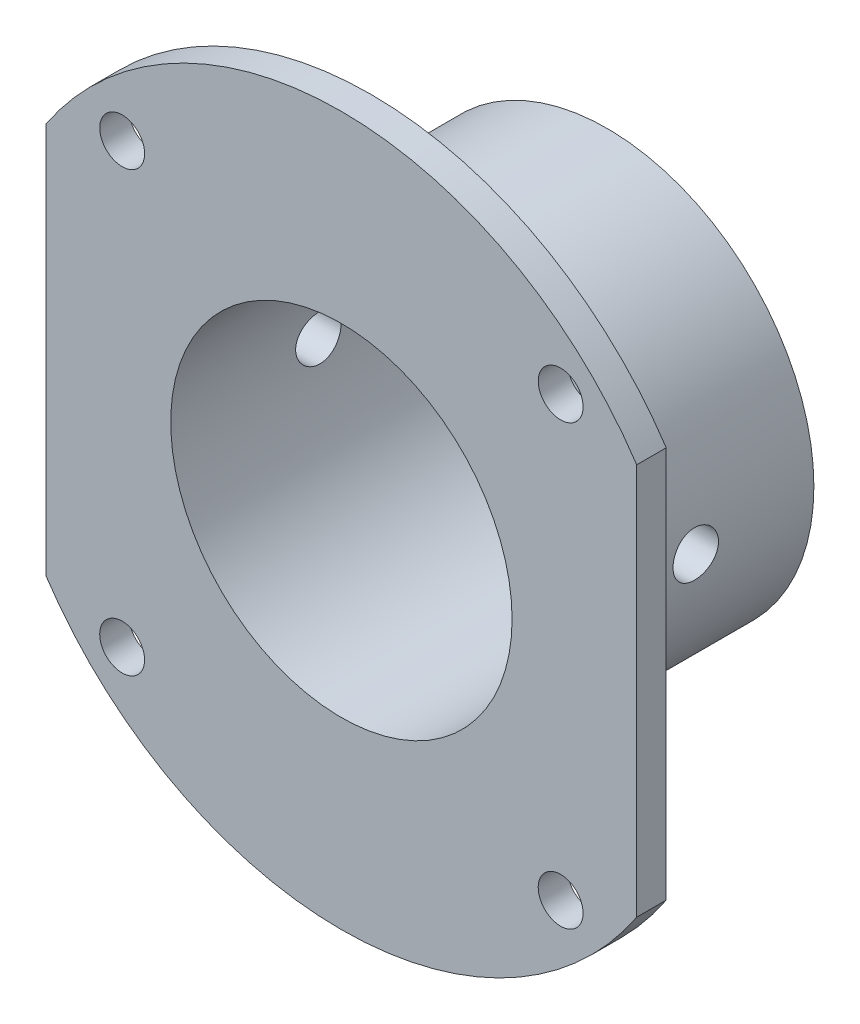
ISO-10303-21;
HEADER;
FILE_DESCRIPTION(('STEP AP214'),'2;1');
FILE_NAME('part.step','',(''),(''),'','','');
FILE_SCHEMA(('AUTOMOTIVE_DESIGN { 1 0 10303 214 1 1 1 1 }'));
ENDSEC;
DATA;
#1=APPLICATION_CONTEXT('core data for automotive mechanical design processes');
#2=APPLICATION_PROTOCOL_DEFINITION('international standard','automotive_design',2000,#1);
#3=PRODUCT_CONTEXT('',#1,'mechanical');
#4=PRODUCT('Part','Part','',(#3));
#5=PRODUCT_RELATED_PRODUCT_CATEGORY('part','',(#4));
#6=PRODUCT_DEFINITION_FORMATION('','',#4);
#7=PRODUCT_DEFINITION_CONTEXT('part definition',#1,'design');
#8=PRODUCT_DEFINITION('design','',#6,#7);
#9=PRODUCT_DEFINITION_SHAPE('','',#8);
#10=(LENGTH_UNIT() NAMED_UNIT(*) SI_UNIT(.MILLI.,.METRE.));
#11=(NAMED_UNIT(*) PLANE_ANGLE_UNIT() SI_UNIT($,.RADIAN.));
#12=(NAMED_UNIT(*) SI_UNIT($,.STERADIAN.) SOLID_ANGLE_UNIT());
#13=UNCERTAINTY_MEASURE_WITH_UNIT(LENGTH_MEASURE(1.E-05),#10,'distance_accuracy_value','');
#14=(GEOMETRIC_REPRESENTATION_CONTEXT(3) GLOBAL_UNCERTAINTY_ASSIGNED_CONTEXT((#13)) GLOBAL_UNIT_ASSIGNED_CONTEXT((#10,
#11,#12)) REPRESENTATION_CONTEXT('',''));
#15=CARTESIAN_POINT('',(0.,0.,0.));
#16=DIRECTION('',(0.,0.,1.));
#17=DIRECTION('',(1.,0.,0.));
#18=AXIS2_PLACEMENT_3D('',#15,#16,#17);
#19=CARTESIAN_POINT('',(0.,0.,50.8));
#20=DIRECTION('',(0.,0.,1.));
#21=DIRECTION('',(1.,0.,0.));
#22=AXIS2_PLACEMENT_3D('',#19,#20,#21);
#23=PLANE('',#22);
#24=CARTESIAN_POINT('',(0.,0.,50.8));
#25=DIRECTION('',(0.,0.,1.));
#26=DIRECTION('',(1.,0.,0.));
#27=AXIS2_PLACEMENT_3D('',#24,#25,#26);
#28=CIRCLE('',#27,44.45);
#29=CARTESIAN_POINT('',(44.45,0.,50.8));
#30=VERTEX_POINT('',#29);
#31=EDGE_CURVE('E104',#30,#30,#28,.T.);
#32=ORIENTED_EDGE('',*,*,#31,.T.);
#33=EDGE_LOOP('',(#32));
#34=FACE_BOUND('',#33,.T.);
#35=CARTESIAN_POINT('',(47.1502889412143,47.1424,50.8));
#36=DIRECTION('',(0.,0.,1.));
#37=DIRECTION('',(1.,0.,0.));
#38=AXIS2_PLACEMENT_3D('',#35,#36,#37);
#39=CIRCLE('',#38,4.826);
#40=CARTESIAN_POINT('',(51.9762889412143,47.1424,50.8));
#41=VERTEX_POINT('',#40);
#42=EDGE_CURVE('E168',#41,#41,#39,.T.);
#43=ORIENTED_EDGE('',*,*,#42,.T.);
#44=EDGE_LOOP('',(#43));
#45=FACE_BOUND('',#44,.T.);
#46=CARTESIAN_POINT('',(47.1423999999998,-47.1502889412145,50.8));
#47=DIRECTION('',(0.,0.,1.));
#48=DIRECTION('',(1.,0.,0.));
#49=AXIS2_PLACEMENT_3D('',#46,#47,#48);
#50=CIRCLE('',#49,4.826);
#51=CARTESIAN_POINT('',(51.9683999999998,-47.1502889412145,50.8));
#52=VERTEX_POINT('',#51);
#53=EDGE_CURVE('E162',#52,#52,#50,.T.);
#54=ORIENTED_EDGE('',*,*,#53,.T.);
#55=EDGE_LOOP('',(#54));
#56=FACE_BOUND('',#55,.T.);
#57=CARTESIAN_POINT('',(-47.1502889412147,-47.1423999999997,50.8));
#58=DIRECTION('',(0.,0.,1.));
#59=DIRECTION('',(1.,0.,0.));
#60=AXIS2_PLACEMENT_3D('',#57,#58,#59);
#61=CIRCLE('',#60,4.826);
#62=CARTESIAN_POINT('',(-42.3242889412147,-47.1423999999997,50.8));
#63=VERTEX_POINT('',#62);
#64=EDGE_CURVE('E156',#63,#63,#61,.T.);
#65=ORIENTED_EDGE('',*,*,#64,.T.);
#66=EDGE_LOOP('',(#65));
#67=FACE_BOUND('',#66,.T.);
#68=CARTESIAN_POINT('',(-47.1423999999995,47.1502889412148,50.8));
#69=DIRECTION('',(0.,0.,1.));
#70=DIRECTION('',(1.,0.,0.));
#71=AXIS2_PLACEMENT_3D('',#68,#69,#70);
#72=CIRCLE('',#71,4.826);
#73=CARTESIAN_POINT('',(-42.3163999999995,47.1502889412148,50.8));
#74=VERTEX_POINT('',#73);
#75=EDGE_CURVE('E150',#74,#74,#72,.T.);
#76=ORIENTED_EDGE('',*,*,#75,.T.);
#77=EDGE_LOOP('',(#76));
#78=FACE_BOUND('',#77,.T.);
#79=DIRECTION('',(0.,-1.,0.));
#80=VECTOR('',#79,1.);
#81=CARTESIAN_POINT('',(-63.5,0.,50.8));
#82=LINE('',#81,#80);
#83=CARTESIAN_POINT('',(-63.5,42.1211348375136,50.8));
#84=VERTEX_POINT('',#83);
#85=CARTESIAN_POINT('',(-63.5,-42.1211348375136,50.8));
#86=VERTEX_POINT('',#85);
#87=EDGE_CURVE('E90',#84,#86,#82,.T.);
#88=ORIENTED_EDGE('',*,*,#87,.F.);
#89=CARTESIAN_POINT('',(0.,0.,50.8));
#90=DIRECTION('',(0.,0.,1.));
#91=DIRECTION('',(1.,0.,0.));
#92=AXIS2_PLACEMENT_3D('',#89,#90,#91);
#93=CIRCLE('',#92,76.2);
#94=CARTESIAN_POINT('',(63.5,42.1211348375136,50.8));
#95=VERTEX_POINT('',#94);
#96=EDGE_CURVE('E88',#95,#84,#93,.T.);
#97=ORIENTED_EDGE('',*,*,#96,.F.);
#98=DIRECTION('',(0.,-1.,0.));
#99=VECTOR('',#98,1.);
#100=CARTESIAN_POINT('',(63.5,0.,50.8));
#101=LINE('',#100,#99);
#102=CARTESIAN_POINT('',(63.5,-42.1211348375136,50.8));
#103=VERTEX_POINT('',#102);
#104=EDGE_CURVE('E182',#95,#103,#101,.T.);
#105=ORIENTED_EDGE('',*,*,#104,.T.);
#106=EDGE_CURVE('E172',#86,#103,#93,.T.);
#107=ORIENTED_EDGE('',*,*,#106,.F.);
#108=EDGE_LOOP('',(#88,#97,#105,#107));
#109=FACE_BOUND('',#108,.T.);
#110=ADVANCED_FACE('F36',(#34,#45,#56,#67,#78,#109),#23,.F.);
#111=CARTESIAN_POINT('',(0.,0.,57.15));
#112=DIRECTION('',(0.,0.,-1.));
#113=DIRECTION('',(-1.,0.,0.));
#114=AXIS2_PLACEMENT_3D('',#111,#112,#113);
#115=CYLINDRICAL_SURFACE('',#114,76.2);
#116=DIRECTION('',(0.,0.,-1.));
#117=VECTOR('',#116,1.);
#118=CARTESIAN_POINT('',(-63.5,42.1211348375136,57.15));
#119=LINE('',#118,#117);
#120=CARTESIAN_POINT('',(-63.5,42.1211348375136,57.15));
#121=VERTEX_POINT('',#120);
#122=EDGE_CURVE('E77',#121,#84,#119,.T.);
#123=ORIENTED_EDGE('',*,*,#122,.F.);
#124=CARTESIAN_POINT('',(0.,0.,57.15));
#125=DIRECTION('',(0.,0.,1.));
#126=DIRECTION('',(1.,0.,0.));
#127=AXIS2_PLACEMENT_3D('',#124,#125,#126);
#128=CIRCLE('',#127,76.2);
#129=CARTESIAN_POINT('',(63.5,42.1211348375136,57.15));
#130=VERTEX_POINT('',#129);
#131=EDGE_CURVE('E86',#130,#121,#128,.T.);
#132=ORIENTED_EDGE('',*,*,#131,.F.);
#133=DIRECTION('',(0.,0.,-1.));
#134=VECTOR('',#133,1.);
#135=CARTESIAN_POINT('',(63.5,42.1211348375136,57.15));
#136=LINE('',#135,#134);
#137=EDGE_CURVE('E59',#130,#95,#136,.T.);
#138=ORIENTED_EDGE('',*,*,#137,.T.);
#139=ORIENTED_EDGE('',*,*,#96,.T.);
#140=EDGE_LOOP('',(#123,#132,#138,#139));
#141=FACE_BOUND('',#140,.T.);
#142=ADVANCED_FACE('F85',(#141),#115,.T.);
#143=DIRECTION('',(0.,0.,-1.));
#144=VECTOR('',#143,1.);
#145=CARTESIAN_POINT('',(-63.5,-42.1211348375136,57.15));
#146=LINE('',#145,#144);
#147=CARTESIAN_POINT('',(-63.5,-42.1211348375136,57.15));
#148=VERTEX_POINT('',#147);
#149=EDGE_CURVE('E52',#86,#148,#146,.F.);
#150=ORIENTED_EDGE('',*,*,#149,.F.);
#151=ORIENTED_EDGE('',*,*,#106,.T.);
#152=DIRECTION('',(0.,0.,-1.));
#153=VECTOR('',#152,1.);
#154=CARTESIAN_POINT('',(63.5,-42.1211348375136,57.15));
#155=LINE('',#154,#153);
#156=CARTESIAN_POINT('',(63.5,-42.1211348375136,57.15));
#157=VERTEX_POINT('',#156);
#158=EDGE_CURVE('E89',#103,#157,#155,.F.);
#159=ORIENTED_EDGE('',*,*,#158,.T.);
#160=EDGE_CURVE('E94',#148,#157,#128,.T.);
#161=ORIENTED_EDGE('',*,*,#160,.F.);
#162=EDGE_LOOP('',(#150,#151,#159,#161));
#163=FACE_BOUND('',#162,.T.);
#164=ADVANCED_FACE('F179',(#163),#115,.T.);
#165=CARTESIAN_POINT('',(0.,0.,57.15));
#166=DIRECTION('',(0.,0.,1.));
#167=DIRECTION('',(1.,0.,0.));
#168=AXIS2_PLACEMENT_3D('',#165,#166,#167);
#169=PLANE('',#168);
#170=CARTESIAN_POINT('',(0.,0.,57.15));
#171=DIRECTION('',(0.,0.,1.));
#172=DIRECTION('',(1.,0.,0.));
#173=AXIS2_PLACEMENT_3D('',#170,#171,#172);
#174=CIRCLE('',#173,36.703);
#175=CARTESIAN_POINT('',(36.703,0.,57.15));
#176=VERTEX_POINT('',#175);
#177=EDGE_CURVE('E170',#176,#176,#174,.T.);
#178=ORIENTED_EDGE('',*,*,#177,.F.);
#179=EDGE_LOOP('',(#178));
#180=FACE_BOUND('',#179,.T.);
#181=CARTESIAN_POINT('',(47.1502889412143,47.1424,57.15));
#182=DIRECTION('',(0.,0.,1.));
#183=DIRECTION('',(1.,0.,0.));
#184=AXIS2_PLACEMENT_3D('',#181,#182,#183);
#185=CIRCLE('',#184,4.826);
#186=CARTESIAN_POINT('',(51.9762889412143,47.1424,57.15));
#187=VERTEX_POINT('',#186);
#188=EDGE_CURVE('E165',#187,#187,#185,.T.);
#189=ORIENTED_EDGE('',*,*,#188,.F.);
#190=EDGE_LOOP('',(#189));
#191=FACE_BOUND('',#190,.T.);
#192=CARTESIAN_POINT('',(47.1423999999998,-47.1502889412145,57.15));
#193=DIRECTION('',(0.,0.,1.));
#194=DIRECTION('',(0.,-1.,0.));
#195=AXIS2_PLACEMENT_3D('',#192,#193,#194);
#196=CIRCLE('',#195,4.826);
#197=CARTESIAN_POINT('',(47.1423999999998,-51.9762889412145,57.15));
#198=VERTEX_POINT('',#197);
#199=EDGE_CURVE('E159',#198,#198,#196,.T.);
#200=ORIENTED_EDGE('',*,*,#199,.F.);
#201=EDGE_LOOP('',(#200));
#202=FACE_BOUND('',#201,.T.);
#203=CARTESIAN_POINT('',(-47.1502889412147,-47.1423999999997,57.15));
#204=DIRECTION('',(0.,0.,1.));
#205=DIRECTION('',(-1.,0.,0.));
#206=AXIS2_PLACEMENT_3D('',#203,#204,#205);
#207=CIRCLE('',#206,4.826);
#208=CARTESIAN_POINT('',(-51.9762889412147,-47.1423999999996,57.15));
#209=VERTEX_POINT('',#208);
#210=EDGE_CURVE('E153',#209,#209,#207,.T.);
#211=ORIENTED_EDGE('',*,*,#210,.F.);
#212=EDGE_LOOP('',(#211));
#213=FACE_BOUND('',#212,.T.);
#214=CARTESIAN_POINT('',(-47.1423999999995,47.1502889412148,57.15));
#215=DIRECTION('',(0.,0.,1.));
#216=DIRECTION('',(0.,1.,0.));
#217=AXIS2_PLACEMENT_3D('',#214,#215,#216);
#218=CIRCLE('',#217,4.826);
#219=CARTESIAN_POINT('',(-47.1423999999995,51.9762889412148,57.15));
#220=VERTEX_POINT('',#219);
#221=EDGE_CURVE('E147',#220,#220,#218,.T.);
#222=ORIENTED_EDGE('',*,*,#221,.F.);
#223=EDGE_LOOP('',(#222));
#224=FACE_BOUND('',#223,.T.);
#225=ORIENTED_EDGE('',*,*,#131,.T.);
#226=DIRECTION('',(0.,-1.,0.));
#227=VECTOR('',#226,1.);
#228=CARTESIAN_POINT('',(-63.5,0.,57.15));
#229=LINE('',#228,#227);
#230=EDGE_CURVE('E11',#121,#148,#229,.T.);
#231=ORIENTED_EDGE('',*,*,#230,.T.);
#232=ORIENTED_EDGE('',*,*,#160,.T.);
#233=DIRECTION('',(0.,-1.,0.));
#234=VECTOR('',#233,1.);
#235=CARTESIAN_POINT('',(63.5,0.,57.15));
#236=LINE('',#235,#234);
#237=EDGE_CURVE('E45',#130,#157,#236,.T.);
#238=ORIENTED_EDGE('',*,*,#237,.F.);
#239=EDGE_LOOP('',(#225,#231,#232,#238));
#240=FACE_BOUND('',#239,.T.);
#241=ADVANCED_FACE('F92',(#180,#191,#202,#213,#224,#240),#169,.T.);
#242=CARTESIAN_POINT('',(0.,0.,0.));
#243=DIRECTION('',(0.,0.,1.));
#244=DIRECTION('',(1.,0.,0.));
#245=AXIS2_PLACEMENT_3D('',#242,#243,#244);
#246=PLANE('',#245);
#247=CARTESIAN_POINT('',(0.,0.,0.));
#248=DIRECTION('',(0.,0.,1.));
#249=DIRECTION('',(1.,0.,0.));
#250=AXIS2_PLACEMENT_3D('',#247,#248,#249);
#251=CIRCLE('',#250,44.45);
#252=CARTESIAN_POINT('',(44.45,0.,0.));
#253=VERTEX_POINT('',#252);
#254=EDGE_CURVE('E97',#253,#253,#251,.T.);
#255=ORIENTED_EDGE('',*,*,#254,.F.);
#256=EDGE_LOOP('',(#255));
#257=FACE_BOUND('',#256,.T.);
#258=CARTESIAN_POINT('',(0.,0.,0.));
#259=DIRECTION('',(0.,0.,1.));
#260=DIRECTION('',(1.,0.,0.));
#261=AXIS2_PLACEMENT_3D('',#258,#259,#260);
#262=CIRCLE('',#261,36.703);
#263=CARTESIAN_POINT('',(36.703,0.,0.));
#264=VERTEX_POINT('',#263);
#265=EDGE_CURVE('E93',#264,#264,#262,.T.);
#266=ORIENTED_EDGE('',*,*,#265,.T.);
#267=EDGE_LOOP('',(#266));
#268=FACE_BOUND('',#267,.T.);
#269=ADVANCED_FACE('F198',(#257,#268),#246,.F.);
#270=CARTESIAN_POINT('',(0.,0.,50.8));
#271=DIRECTION('',(0.,0.,-1.));
#272=DIRECTION('',(-1.,0.,0.));
#273=AXIS2_PLACEMENT_3D('',#270,#271,#272);
#274=CYLINDRICAL_SURFACE('',#273,44.45);
#275=CARTESIAN_POINT('',(-44.45,0.,30.2895));
#276=CARTESIAN_POINT('',(-44.4500004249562,-0.136927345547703,30.2895014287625));
#277=CARTESIAN_POINT('',(-44.4493660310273,-0.27383320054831,30.2837460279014));
#278=CARTESIAN_POINT('',(-44.4468470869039,-0.546711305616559,30.2607676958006));
#279=CARTESIAN_POINT('',(-44.4449622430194,-0.682683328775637,30.2435420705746));
#280=CARTESIAN_POINT('',(-44.4399928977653,-0.952782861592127,30.1977281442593));
#281=CARTESIAN_POINT('',(-44.4369074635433,-1.08690885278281,30.1691310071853));
#282=CARTESIAN_POINT('',(-44.4296229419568,-1.35230694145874,30.1007722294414));
#283=CARTESIAN_POINT('',(-44.4254234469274,-1.48357797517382,30.0610065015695));
#284=CARTESIAN_POINT('',(-44.4160344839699,-1.74215492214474,29.970650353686));
#285=CARTESIAN_POINT('',(-44.4108460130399,-1.86946467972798,29.9200708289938));
#286=CARTESIAN_POINT('',(-44.3996200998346,-2.11940844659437,29.8084078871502));
#287=CARTESIAN_POINT('',(-44.3935823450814,-2.24204071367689,29.747320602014));
#288=CARTESIAN_POINT('',(-44.3808323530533,-2.48165434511,29.6151291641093));
#289=CARTESIAN_POINT('',(-44.3741204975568,-2.59863885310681,29.5440306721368));
#290=CARTESIAN_POINT('',(-44.36020477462,-2.82625916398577,29.3922659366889));
#291=CARTESIAN_POINT('',(-44.3530007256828,-2.93689259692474,29.3115961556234));
#292=CARTESIAN_POINT('',(-44.3382789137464,-3.15136791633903,29.1409802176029));
#293=CARTESIAN_POINT('',(-44.3307601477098,-3.25518486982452,29.0510028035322));
#294=CARTESIAN_POINT('',(-44.3156415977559,-3.4549162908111,28.8626027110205));
#295=CARTESIAN_POINT('',(-44.308041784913,-3.55082782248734,28.7641769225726));
#296=CARTESIAN_POINT('',(-44.2929809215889,-3.73400405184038,28.5596306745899));
#297=CARTESIAN_POINT('',(-44.2855198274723,-3.82127150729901,28.4535126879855));
#298=CARTESIAN_POINT('',(-44.2709422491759,-3.9866106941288,28.2342556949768));
#299=CARTESIAN_POINT('',(-44.2638258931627,-4.06467902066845,28.12111411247));
#300=CARTESIAN_POINT('',(-44.250127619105,-4.21119154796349,27.8883779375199));
#301=CARTESIAN_POINT('',(-44.2435469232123,-4.27961398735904,27.7687695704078));
#302=CARTESIAN_POINT('',(-44.2311236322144,-4.40616002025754,27.5241327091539));
#303=CARTESIAN_POINT('',(-44.2252813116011,-4.46427978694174,27.3991022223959));
#304=CARTESIAN_POINT('',(-44.2145081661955,-4.56974684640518,27.1445863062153));
#305=CARTESIAN_POINT('',(-44.2095769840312,-4.61709836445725,27.0151026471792));
#306=CARTESIAN_POINT('',(-44.2007627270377,-4.70072499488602,26.752557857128));
#307=CARTESIAN_POINT('',(-44.1968800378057,-4.73699603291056,26.6194954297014));
#308=CARTESIAN_POINT('',(-44.1870177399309,-4.82845005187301,26.2175481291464));
#309=CARTESIAN_POINT('',(-44.1827660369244,-4.86682144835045,25.9445777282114));
#310=CARTESIAN_POINT('',(-44.1794068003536,-4.89721519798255,25.3961896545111));
#311=CARTESIAN_POINT('',(-44.1802991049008,-4.88923900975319,25.1207720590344));
#312=CARTESIAN_POINT('',(-44.18710087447,-4.82737670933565,24.5764034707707));
#313=CARTESIAN_POINT('',(-44.1929882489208,-4.77369273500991,24.3074293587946));
#314=CARTESIAN_POINT('',(-44.2090846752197,-4.62223738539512,23.7823422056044));
#315=CARTESIAN_POINT('',(-44.2192937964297,-4.52446530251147,23.5262293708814));
#316=CARTESIAN_POINT('',(-44.2429080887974,-4.2873924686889,23.0334871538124));
#317=CARTESIAN_POINT('',(-44.2563200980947,-4.14800270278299,22.7969009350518));
#318=CARTESIAN_POINT('',(-44.2848235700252,-3.83171395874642,22.3504038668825));
#319=CARTESIAN_POINT('',(-44.2999150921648,-3.65481365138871,22.1404939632));
#320=CARTESIAN_POINT('',(-44.3301755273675,-3.26739964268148,21.7521327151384));
#321=CARTESIAN_POINT('',(-44.3453444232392,-3.05671144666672,21.5738553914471));
#322=CARTESIAN_POINT('',(-44.3739746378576,-2.60830623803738,21.255171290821));
#323=CARTESIAN_POINT('',(-44.3874359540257,-2.37058918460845,21.114764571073));
#324=CARTESIAN_POINT('',(-44.4111400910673,-1.87474853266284,20.8758115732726));
#325=CARTESIAN_POINT('',(-44.4213821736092,-1.61662026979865,20.7772748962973));
#326=CARTESIAN_POINT('',(-44.4374866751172,-1.08734477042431,20.6249905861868));
#327=CARTESIAN_POINT('',(-44.443349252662,-0.816198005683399,20.5712413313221));
#328=CARTESIAN_POINT('',(-44.4500137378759,-0.270088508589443,20.5102801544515));
#329=CARTESIAN_POINT('',(-44.4508417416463,0.00484712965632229,20.502828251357));
#330=CARTESIAN_POINT('',(-44.4474139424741,0.552051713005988,20.5340418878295));
#331=CARTESIAN_POINT('',(-44.4431582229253,0.824320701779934,20.5727066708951));
#332=CARTESIAN_POINT('',(-44.4300576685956,1.35776484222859,20.6948569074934));
#333=CARTESIAN_POINT('',(-44.4212244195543,1.61896620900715,20.7782292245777));
#334=CARTESIAN_POINT('',(-44.3999589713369,2.12367738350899,20.9873111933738));
#335=CARTESIAN_POINT('',(-44.3875266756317,2.3671867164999,21.1130219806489));
#336=CARTESIAN_POINT('',(-44.3603869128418,2.83068161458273,21.4038018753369));
#337=CARTESIAN_POINT('',(-44.3456704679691,3.0505682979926,21.5690277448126));
#338=CARTESIAN_POINT('',(-44.3156404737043,3.4595731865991,21.9339249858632));
#339=CARTESIAN_POINT('',(-44.3003269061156,3.6486904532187,22.1335974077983));
#340=CARTESIAN_POINT('',(-44.2707492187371,3.99162861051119,22.562767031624));
#341=CARTESIAN_POINT('',(-44.2564899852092,4.145291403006,22.7923909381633));
#342=CARTESIAN_POINT('',(-44.2307125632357,4.41186847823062,23.274337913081));
#343=CARTESIAN_POINT('',(-44.2191943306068,4.52478341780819,23.5266606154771));
#344=CARTESIAN_POINT('',(-44.2002333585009,4.70640323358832,24.0462611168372));
#345=CARTESIAN_POINT('',(-44.1927821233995,4.77520032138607,24.3135064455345));
#346=CARTESIAN_POINT('',(-44.1827783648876,4.86691088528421,24.8559928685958));
#347=CARTESIAN_POINT('',(-44.1802256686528,4.88982598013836,25.131233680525));
#348=CARTESIAN_POINT('',(-44.1802763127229,4.88933189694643,25.5430335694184));
#349=CARTESIAN_POINT('',(-44.180934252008,4.88340604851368,25.6798299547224));
#350=CARTESIAN_POINT('',(-44.1835031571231,4.86011494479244,25.9524198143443));
#351=CARTESIAN_POINT('',(-44.1854136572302,4.84275394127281,26.0882136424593));
#352=CARTESIAN_POINT('',(-44.1904359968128,4.79670652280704,26.3578856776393));
#353=CARTESIAN_POINT('',(-44.1935482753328,4.76801596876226,26.4917631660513));
#354=CARTESIAN_POINT('',(-44.2008830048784,4.69953485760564,26.7565673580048));
#355=CARTESIAN_POINT('',(-44.2051050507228,4.65974835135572,26.8874951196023));
#356=CARTESIAN_POINT('',(-44.2145403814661,4.56935245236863,27.145543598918));
#357=CARTESIAN_POINT('',(-44.2197538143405,4.51874144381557,27.2726637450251));
#358=CARTESIAN_POINT('',(-44.2310213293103,4.4070849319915,27.522140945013));
#359=CARTESIAN_POINT('',(-44.2370751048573,4.34604323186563,27.6444997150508));
#360=CARTESIAN_POINT('',(-44.2498559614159,4.21392350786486,27.8836934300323));
#361=CARTESIAN_POINT('',(-44.2565832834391,4.1428418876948,28.000526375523));
#362=CARTESIAN_POINT('',(-44.2705173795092,3.99118836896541,28.2277691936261));
#363=CARTESIAN_POINT('',(-44.2777239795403,3.91061990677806,28.3381813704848));
#364=CARTESIAN_POINT('',(-44.2924573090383,3.74006546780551,28.552455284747));
#365=CARTESIAN_POINT('',(-44.2999855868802,3.65002993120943,28.6562774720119));
#366=CARTESIAN_POINT('',(-44.3151091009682,3.4615798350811,28.8559388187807));
#367=CARTESIAN_POINT('',(-44.3227043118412,3.36316833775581,28.9517808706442));
#368=CARTESIAN_POINT('',(-44.3377547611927,3.15856432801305,29.1349086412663));
#369=CARTESIAN_POINT('',(-44.3452099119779,3.05236713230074,29.2221891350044));
#370=CARTESIAN_POINT('',(-44.3597624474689,2.83302824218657,29.3874819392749));
#371=CARTESIAN_POINT('',(-44.3668599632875,2.7198891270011,29.4654976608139));
#372=CARTESIAN_POINT('',(-44.380523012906,2.48703078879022,29.6119914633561));
#373=CARTESIAN_POINT('',(-44.387086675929,2.36729070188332,29.6804365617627));
#374=CARTESIAN_POINT('',(-44.3994664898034,2.12247287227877,29.8069602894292));
#375=CARTESIAN_POINT('',(-44.4052829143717,1.99739710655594,29.8650427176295));
#376=CARTESIAN_POINT('',(-44.4160012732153,1.7428536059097,29.9704077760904));
#377=CARTESIAN_POINT('',(-44.4209039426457,1.61338950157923,30.0176990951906));
#378=CARTESIAN_POINT('',(-44.4296601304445,1.35094244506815,30.1011837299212));
#379=CARTESIAN_POINT('',(-44.4335139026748,1.21796035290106,30.1373797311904));
#380=CARTESIAN_POINT('',(-44.4411176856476,0.906117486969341,30.2082522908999));
#381=CARTESIAN_POINT('',(-44.4444350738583,0.726266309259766,30.2386901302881));
#382=CARTESIAN_POINT('',(-44.4488759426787,0.364264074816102,30.2793129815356));
#383=CARTESIAN_POINT('',(-44.4499994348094,0.182113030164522,30.2894980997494));
#384=CARTESIAN_POINT('',(-44.45,0.,30.2895));
#385=B_SPLINE_CURVE_WITH_KNOTS('',3,(#275,#276,#277,#278,#279,#280,#281,#282,#283,#284,#285,
#286,#287,#288,#289,#290,#291,#292,#293,#294,#295,#296,#297,#298,#299,#300,#301,#302,#303,#304,
#305,#306,#307,#308,#309,#310,#311,#312,#313,#314,#315,#316,#317,#318,#319,#320,#321,#322,#323,
#324,#325,#326,#327,#328,#329,#330,#331,#332,#333,#334,#335,#336,#337,#338,#339,#340,#341,#342,
#343,#344,#345,#346,#347,#348,#349,#350,#351,#352,#353,#354,#355,#356,#357,#358,#359,#360,#361,
#362,#363,#364,#365,#366,#367,#368,#369,#370,#371,#372,#373,#374,#375,#376,#377,#378,#379,#380,
#381,#382,#383,#384),.UNSPECIFIED.,.T.,.F.,(4,2,2,2,2,2,2,2,2,2,2,2,2,2,2,2,2,2,2,2,2,2,2,2,2,2,
2,2,2,2,2,2,2,2,2,2,2,2,2,2,2,2,2,2,2,2,2,2,2,2,2,2,2,2,4),(0.,0.410622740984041,
0.821341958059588,1.23238094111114,1.64357054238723,2.05434779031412,2.46527657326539,
2.87597392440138,3.28682354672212,3.69910067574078,4.11153022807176,4.52382777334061,
4.93627744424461,5.34964321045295,5.76316219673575,6.1765186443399,6.59002690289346,
7.41279235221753,8.23553190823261,9.05465177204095,9.8737847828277,10.6946825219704,
11.5156093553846,12.340921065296,13.1662340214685,13.9917361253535,14.8172083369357,
15.6383981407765,16.4595744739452,17.2786824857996,18.0978124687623,18.9202475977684,
19.7427078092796,20.5687675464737,21.3948139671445,22.2191281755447,23.0434133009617,
23.4537927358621,23.8640196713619,24.2743966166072,24.6846239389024,25.0949125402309,
25.5050518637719,25.9153384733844,26.3254769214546,26.7378807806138,27.1501345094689,
27.5626382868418,27.9749897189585,28.3887289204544,28.8023161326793,29.2155691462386,
29.6287220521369,30.1748521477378,30.7209793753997),.UNSPECIFIED.);
#386=CARTESIAN_POINT('',(-44.45,0.,30.2895));
#387=VERTEX_POINT('',#386);
#388=EDGE_CURVE('E136',#387,#387,#385,.T.);
#389=ORIENTED_EDGE('',*,*,#388,.T.);
#390=EDGE_LOOP('',(#389));
#391=FACE_BOUND('',#390,.T.);
#392=CARTESIAN_POINT('',(44.45,0.,20.5105));
#393=CARTESIAN_POINT('',(44.4500004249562,-0.136927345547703,20.5104985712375));
#394=CARTESIAN_POINT('',(44.4493660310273,-0.27383320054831,20.5162539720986));
#395=CARTESIAN_POINT('',(44.4468470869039,-0.54671130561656,20.5392323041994));
#396=CARTESIAN_POINT('',(44.4449622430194,-0.682683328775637,20.5564579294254));
#397=CARTESIAN_POINT('',(44.4399928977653,-0.952782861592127,20.6022718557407));
#398=CARTESIAN_POINT('',(44.4369074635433,-1.08690885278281,20.6308689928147));
#399=CARTESIAN_POINT('',(44.4296229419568,-1.35230694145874,20.6992277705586));
#400=CARTESIAN_POINT('',(44.4254234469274,-1.48357797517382,20.7389934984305));
#401=CARTESIAN_POINT('',(44.4160344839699,-1.74215492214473,20.829349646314));
#402=CARTESIAN_POINT('',(44.4108460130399,-1.86946467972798,20.8799291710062));
#403=CARTESIAN_POINT('',(44.3996200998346,-2.11940844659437,20.9915921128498));
#404=CARTESIAN_POINT('',(44.3935823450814,-2.24204071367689,21.052679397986));
#405=CARTESIAN_POINT('',(44.3808323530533,-2.48165434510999,21.1848708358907));
#406=CARTESIAN_POINT('',(44.3741204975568,-2.59863885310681,21.2559693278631));
#407=CARTESIAN_POINT('',(44.36020477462,-2.82625916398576,21.4077340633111));
#408=CARTESIAN_POINT('',(44.3530007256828,-2.93689259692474,21.4884038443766));
#409=CARTESIAN_POINT('',(44.3382789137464,-3.15136791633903,21.6590197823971));
#410=CARTESIAN_POINT('',(44.3307601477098,-3.25518486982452,21.7489971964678));
#411=CARTESIAN_POINT('',(44.3156415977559,-3.45491629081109,21.9373972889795));
#412=CARTESIAN_POINT('',(44.308041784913,-3.55082782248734,22.0358230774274));
#413=CARTESIAN_POINT('',(44.2929809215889,-3.73400405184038,22.2403693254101));
#414=CARTESIAN_POINT('',(44.2855198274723,-3.821271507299,22.3464873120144));
#415=CARTESIAN_POINT('',(44.2709422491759,-3.9866106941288,22.5657443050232));
#416=CARTESIAN_POINT('',(44.2638258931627,-4.06467902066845,22.67888588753));
#417=CARTESIAN_POINT('',(44.250127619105,-4.21119154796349,22.9116220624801));
#418=CARTESIAN_POINT('',(44.2435469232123,-4.27961398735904,23.0312304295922));
#419=CARTESIAN_POINT('',(44.2311236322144,-4.40616002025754,23.2758672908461));
#420=CARTESIAN_POINT('',(44.2252813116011,-4.46427978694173,23.4008977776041));
#421=CARTESIAN_POINT('',(44.2145081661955,-4.56974684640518,23.6554136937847));
#422=CARTESIAN_POINT('',(44.2095769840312,-4.61709836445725,23.7848973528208));
#423=CARTESIAN_POINT('',(44.2007627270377,-4.70072499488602,24.047442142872));
#424=CARTESIAN_POINT('',(44.1968800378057,-4.73699603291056,24.1805045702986));
#425=CARTESIAN_POINT('',(44.1870177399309,-4.82845005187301,24.5824518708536));
#426=CARTESIAN_POINT('',(44.1827660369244,-4.86682144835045,24.8554222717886));
#427=CARTESIAN_POINT('',(44.1794068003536,-4.89721519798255,25.4038103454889));
#428=CARTESIAN_POINT('',(44.1802991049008,-4.88923900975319,25.6792279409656));
#429=CARTESIAN_POINT('',(44.18710087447,-4.82737670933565,26.2235965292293));
#430=CARTESIAN_POINT('',(44.1929882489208,-4.77369273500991,26.4925706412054));
#431=CARTESIAN_POINT('',(44.2090846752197,-4.62223738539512,27.0176577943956));
#432=CARTESIAN_POINT('',(44.2192937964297,-4.52446530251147,27.2737706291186));
#433=CARTESIAN_POINT('',(44.2429080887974,-4.2873924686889,27.7665128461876));
#434=CARTESIAN_POINT('',(44.2563200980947,-4.148002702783,28.0030990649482));
#435=CARTESIAN_POINT('',(44.2848235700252,-3.83171395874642,28.4495961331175));
#436=CARTESIAN_POINT('',(44.2999150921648,-3.65481365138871,28.6595060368));
#437=CARTESIAN_POINT('',(44.3301755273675,-3.26739964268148,29.0478672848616));
#438=CARTESIAN_POINT('',(44.3453444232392,-3.05671144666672,29.2261446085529));
#439=CARTESIAN_POINT('',(44.3739746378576,-2.60830623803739,29.544828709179));
#440=CARTESIAN_POINT('',(44.3874359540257,-2.37058918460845,29.685235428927));
#441=CARTESIAN_POINT('',(44.4111400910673,-1.87474853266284,29.9241884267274));
#442=CARTESIAN_POINT('',(44.4213821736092,-1.61662026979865,30.0227251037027));
#443=CARTESIAN_POINT('',(44.4374866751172,-1.08734477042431,30.1750094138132));
#444=CARTESIAN_POINT('',(44.443349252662,-0.816198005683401,30.2287586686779));
#445=CARTESIAN_POINT('',(44.4500137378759,-0.270088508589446,30.2897198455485));
#446=CARTESIAN_POINT('',(44.4508417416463,0.00484712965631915,30.297171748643));
#447=CARTESIAN_POINT('',(44.4474139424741,0.552051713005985,30.2659581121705));
#448=CARTESIAN_POINT('',(44.4431582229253,0.824320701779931,30.2272933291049));
#449=CARTESIAN_POINT('',(44.4300576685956,1.35776484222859,30.1051430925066));
#450=CARTESIAN_POINT('',(44.4212244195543,1.61896620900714,30.0217707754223));
#451=CARTESIAN_POINT('',(44.3999589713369,2.12367738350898,29.8126888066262));
#452=CARTESIAN_POINT('',(44.3875266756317,2.36718671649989,29.6869780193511));
#453=CARTESIAN_POINT('',(44.3603869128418,2.83068161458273,29.3961981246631));
#454=CARTESIAN_POINT('',(44.3456704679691,3.0505682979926,29.2309722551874));
#455=CARTESIAN_POINT('',(44.3156404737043,3.45957318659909,28.8660750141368));
#456=CARTESIAN_POINT('',(44.3003269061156,3.64869045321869,28.6664025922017));
#457=CARTESIAN_POINT('',(44.2707492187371,3.99162861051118,28.237232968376));
#458=CARTESIAN_POINT('',(44.2564899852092,4.145291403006,28.0076090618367));
#459=CARTESIAN_POINT('',(44.2307125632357,4.41186847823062,27.525662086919));
#460=CARTESIAN_POINT('',(44.2191943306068,4.52478341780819,27.2733393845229));
#461=CARTESIAN_POINT('',(44.2002333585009,4.70640323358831,26.7537388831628));
#462=CARTESIAN_POINT('',(44.1927821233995,4.77520032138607,26.4864935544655));
#463=CARTESIAN_POINT('',(44.1827783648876,4.86691088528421,25.9440071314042));
#464=CARTESIAN_POINT('',(44.1802256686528,4.88982598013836,25.668766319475));
#465=CARTESIAN_POINT('',(44.1802763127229,4.88933189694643,25.2569664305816));
#466=CARTESIAN_POINT('',(44.180934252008,4.88340604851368,25.1201700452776));
#467=CARTESIAN_POINT('',(44.1835031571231,4.86011494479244,24.8475801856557));
#468=CARTESIAN_POINT('',(44.1854136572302,4.84275394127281,24.7117863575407));
#469=CARTESIAN_POINT('',(44.1904359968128,4.79670652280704,24.4421143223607));
#470=CARTESIAN_POINT('',(44.1935482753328,4.76801596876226,24.3082368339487));
#471=CARTESIAN_POINT('',(44.2008830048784,4.69953485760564,24.0434326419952));
#472=CARTESIAN_POINT('',(44.2051050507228,4.65974835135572,23.9125048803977));
#473=CARTESIAN_POINT('',(44.2145403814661,4.56935245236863,23.654456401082));
#474=CARTESIAN_POINT('',(44.2197538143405,4.51874144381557,23.5273362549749));
#475=CARTESIAN_POINT('',(44.2310213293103,4.4070849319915,23.277859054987));
#476=CARTESIAN_POINT('',(44.2370751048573,4.34604323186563,23.1555002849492));
#477=CARTESIAN_POINT('',(44.2498559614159,4.21392350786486,22.9163065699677));
#478=CARTESIAN_POINT('',(44.2565832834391,4.14284188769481,22.799473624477));
#479=CARTESIAN_POINT('',(44.2705173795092,3.99118836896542,22.5722308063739));
#480=CARTESIAN_POINT('',(44.2777239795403,3.91061990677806,22.4618186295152));
#481=CARTESIAN_POINT('',(44.2924573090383,3.74006546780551,22.247544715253));
#482=CARTESIAN_POINT('',(44.2999855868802,3.65002993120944,22.1437225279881));
#483=CARTESIAN_POINT('',(44.3151091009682,3.46157983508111,21.9440611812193));
#484=CARTESIAN_POINT('',(44.3227043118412,3.36316833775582,21.8482191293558));
#485=CARTESIAN_POINT('',(44.3377547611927,3.15856432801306,21.6650913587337));
#486=CARTESIAN_POINT('',(44.3452099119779,3.05236713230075,21.5778108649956));
#487=CARTESIAN_POINT('',(44.3597624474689,2.83302824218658,21.4125180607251));
#488=CARTESIAN_POINT('',(44.3668599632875,2.71988912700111,21.3345023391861));
#489=CARTESIAN_POINT('',(44.380523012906,2.48703078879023,21.1880085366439));
#490=CARTESIAN_POINT('',(44.387086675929,2.36729070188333,21.1195634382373));
#491=CARTESIAN_POINT('',(44.3994664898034,2.12247287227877,20.9930397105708));
#492=CARTESIAN_POINT('',(44.4052829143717,1.99739710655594,20.9349572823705));
#493=CARTESIAN_POINT('',(44.4160012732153,1.74285360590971,20.8295922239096));
#494=CARTESIAN_POINT('',(44.4209039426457,1.61338950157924,20.7823009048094));
#495=CARTESIAN_POINT('',(44.4296601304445,1.35094244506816,20.6988162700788));
#496=CARTESIAN_POINT('',(44.4335139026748,1.21796035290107,20.6626202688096));
#497=CARTESIAN_POINT('',(44.4411176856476,0.906117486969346,20.5917477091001));
#498=CARTESIAN_POINT('',(44.4444350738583,0.72626630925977,20.5613098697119));
#499=CARTESIAN_POINT('',(44.4488759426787,0.364264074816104,20.5206870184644));
#500=CARTESIAN_POINT('',(44.4499994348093,0.182113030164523,20.5105019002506));
#501=CARTESIAN_POINT('',(44.45,0.,20.5105));
#502=B_SPLINE_CURVE_WITH_KNOTS('',3,(#392,#393,#394,#395,#396,#397,#398,#399,#400,#401,#402,
#403,#404,#405,#406,#407,#408,#409,#410,#411,#412,#413,#414,#415,#416,#417,#418,#419,#420,#421,
#422,#423,#424,#425,#426,#427,#428,#429,#430,#431,#432,#433,#434,#435,#436,#437,#438,#439,#440,
#441,#442,#443,#444,#445,#446,#447,#448,#449,#450,#451,#452,#453,#454,#455,#456,#457,#458,#459,
#460,#461,#462,#463,#464,#465,#466,#467,#468,#469,#470,#471,#472,#473,#474,#475,#476,#477,#478,
#479,#480,#481,#482,#483,#484,#485,#486,#487,#488,#489,#490,#491,#492,#493,#494,#495,#496,#497,
#498,#499,#500,#501),.UNSPECIFIED.,.T.,.F.,(4,2,2,2,2,2,2,2,2,2,2,2,2,2,2,2,2,2,2,2,2,2,2,2,2,2,
2,2,2,2,2,2,2,2,2,2,2,2,2,2,2,2,2,2,2,2,2,2,2,2,2,2,2,2,4),(0.,0.410622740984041,
0.821341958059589,1.23238094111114,1.64357054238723,2.05434779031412,2.46527657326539,
2.87597392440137,3.28682354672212,3.69910067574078,4.11153022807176,4.52382777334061,
4.93627744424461,5.34964321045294,5.76316219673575,6.1765186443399,6.59002690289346,
7.41279235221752,8.23553190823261,9.05465177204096,9.8737847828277,10.6946825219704,
11.5156093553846,12.340921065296,13.1662340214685,13.9917361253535,14.8172083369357,
15.6383981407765,16.4595744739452,17.2786824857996,18.0978124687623,18.9202475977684,
19.7427078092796,20.5687675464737,21.3948139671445,22.2191281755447,23.0434133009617,
23.453792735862,23.8640196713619,24.2743966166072,24.6846239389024,25.0949125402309,
25.5050518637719,25.9153384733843,26.3254769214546,26.7378807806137,27.1501345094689,
27.5626382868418,27.9749897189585,28.3887289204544,28.8023161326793,29.2155691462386,
29.6287220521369,30.1748521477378,30.7209793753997),.UNSPECIFIED.);
#503=CARTESIAN_POINT('',(44.45,0.,20.5105));
#504=VERTEX_POINT('',#503);
#505=EDGE_CURVE('E141',#504,#504,#502,.T.);
#506=ORIENTED_EDGE('',*,*,#505,.T.);
#507=EDGE_LOOP('',(#506));
#508=FACE_BOUND('',#507,.T.);
#509=ORIENTED_EDGE('',*,*,#31,.F.);
#510=EDGE_LOOP('',(#509));
#511=FACE_BOUND('',#510,.T.);
#512=ORIENTED_EDGE('',*,*,#254,.T.);
#513=EDGE_LOOP('',(#512));
#514=FACE_BOUND('',#513,.T.);
#515=ADVANCED_FACE('F38',(#391,#508,#511,#514),#274,.T.);
#516=CARTESIAN_POINT('',(0.,0.,50.8));
#517=DIRECTION('',(0.,0.,-1.));
#518=DIRECTION('',(-1.,0.,0.));
#519=AXIS2_PLACEMENT_3D('',#516,#517,#518);
#520=CYLINDRICAL_SURFACE('',#519,36.703);
#521=CARTESIAN_POINT('',(-36.703,0.,30.2895));
#522=CARTESIAN_POINT('',(-36.7030005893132,-0.136721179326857,30.2895016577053));
#523=CARTESIAN_POINT('',(-36.702234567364,-0.273418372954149,30.2837634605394));
#524=CARTESIAN_POINT('',(-36.6991931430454,-0.545877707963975,30.2608553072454));
#525=CARTESIAN_POINT('',(-36.6969174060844,-0.681639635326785,30.24368281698));
#526=CARTESIAN_POINT('',(-36.690917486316,-0.951310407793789,30.1980138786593));
#527=CARTESIAN_POINT('',(-36.6871922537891,-1.0852178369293,30.1695092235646));
#528=CARTESIAN_POINT('',(-36.6783969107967,-1.35017998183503,30.1013766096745));
#529=CARTESIAN_POINT('',(-36.6733263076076,-1.48123363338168,30.061744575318));
#530=CARTESIAN_POINT('',(-36.6619894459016,-1.73937179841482,29.97170232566));
#531=CARTESIAN_POINT('',(-36.6557244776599,-1.86646042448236,29.921303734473));
#532=CARTESIAN_POINT('',(-36.6421680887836,-2.11597367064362,29.8100488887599));
#533=CARTESIAN_POINT('',(-36.6348762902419,-2.23839655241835,29.7491887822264));
#534=CARTESIAN_POINT('',(-36.6194756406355,-2.47761438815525,29.6174956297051));
#535=CARTESIAN_POINT('',(-36.6113672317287,-2.59441233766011,29.5466679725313));
#536=CARTESIAN_POINT('',(-36.5945525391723,-2.82168833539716,29.3954874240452));
#537=CARTESIAN_POINT('',(-36.5858460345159,-2.93216401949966,29.3151310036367));
#538=CARTESIAN_POINT('',(-36.5680337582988,-3.14654534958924,29.1450343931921));
#539=CARTESIAN_POINT('',(-36.5589261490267,-3.2504139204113,29.0552476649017));
#540=CARTESIAN_POINT('',(-36.5406066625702,-3.45026803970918,28.8672309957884));
#541=CARTESIAN_POINT('',(-36.5313947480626,-3.54625065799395,28.7689979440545));
#542=CARTESIAN_POINT('',(-36.5131322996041,-3.72959324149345,28.5648322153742));
#543=CARTESIAN_POINT('',(-36.5040817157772,-3.81695591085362,28.4589019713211));
#544=CARTESIAN_POINT('',(-36.4863912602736,-3.98251142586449,28.2400089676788));
#545=CARTESIAN_POINT('',(-36.4777515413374,-4.06070087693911,28.1270436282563));
#546=CARTESIAN_POINT('',(-36.4611026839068,-4.20757466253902,27.8944945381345));
#547=CARTESIAN_POINT('',(-36.4530958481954,-4.27622491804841,27.7748890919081));
#548=CARTESIAN_POINT('',(-36.4379735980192,-4.40322385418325,27.530220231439));
#549=CARTESIAN_POINT('',(-36.4308585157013,-4.46156869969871,27.4051548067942));
#550=CARTESIAN_POINT('',(-36.417732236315,-4.56747673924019,27.1505314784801));
#551=CARTESIAN_POINT('',(-36.411720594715,-4.61504427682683,27.0209754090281));
#552=CARTESIAN_POINT('',(-36.4009690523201,-4.69908812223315,26.7582491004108));
#553=CARTESIAN_POINT('',(-36.3962296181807,-4.73556036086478,26.6250775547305));
#554=CARTESIAN_POINT('',(-36.3841967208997,-4.82746908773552,26.2232573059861));
#555=CARTESIAN_POINT('',(-36.3789924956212,-4.86614731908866,25.9504941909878));
#556=CARTESIAN_POINT('',(-36.3748235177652,-4.8972072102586,25.4024518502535));
#557=CARTESIAN_POINT('',(-36.375858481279,-4.88959097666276,25.1271727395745));
#558=CARTESIAN_POINT('',(-36.3840093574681,-4.82856051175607,24.5836182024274));
#559=CARTESIAN_POINT('',(-36.3910856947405,-4.77544433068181,24.3153088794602));
#560=CARTESIAN_POINT('',(-36.4104631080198,-4.62537095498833,23.791456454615));
#561=CARTESIAN_POINT('',(-36.4227643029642,-4.52841276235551,23.5359136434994));
#562=CARTESIAN_POINT('',(-36.4512491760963,-4.29309477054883,23.0439149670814));
#563=CARTESIAN_POINT('',(-36.4674448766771,-4.15460643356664,22.8075212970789));
#564=CARTESIAN_POINT('',(-36.5018850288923,-3.84024998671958,22.3612166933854));
#565=CARTESIAN_POINT('',(-36.5201295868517,-3.66437993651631,22.1513071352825));
#566=CARTESIAN_POINT('',(-36.5567873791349,-3.2786052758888,21.7621987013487));
#567=CARTESIAN_POINT('',(-36.5752008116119,-3.06844388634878,21.5832543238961));
#568=CARTESIAN_POINT('',(-36.6099877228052,-2.62093351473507,21.2631410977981));
#569=CARTESIAN_POINT('',(-36.6263611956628,-2.38358445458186,21.1219723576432));
#570=CARTESIAN_POINT('',(-36.6552355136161,-1.88823245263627,20.8814134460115));
#571=CARTESIAN_POINT('',(-36.6677347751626,-1.63022111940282,20.7820403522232));
#572=CARTESIAN_POINT('',(-36.6874383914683,-1.10097014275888,20.6281015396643));
#573=CARTESIAN_POINT('',(-36.6946430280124,-0.829731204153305,20.5735334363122));
#574=CARTESIAN_POINT('',(-36.7029087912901,-0.283923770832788,20.5110860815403));
#575=CARTESIAN_POINT('',(-36.7040160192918,-0.00939603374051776,20.5028564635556));
#576=CARTESIAN_POINT('',(-36.7000869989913,0.537123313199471,20.5323934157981));
#577=CARTESIAN_POINT('',(-36.6950508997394,0.809114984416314,20.5701588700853));
#578=CARTESIAN_POINT('',(-36.6794297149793,1.34179904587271,20.6903227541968));
#579=CARTESIAN_POINT('',(-36.668865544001,1.60253004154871,20.7725529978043));
#580=CARTESIAN_POINT('',(-36.6433702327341,2.10650237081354,20.97913668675));
#581=CARTESIAN_POINT('',(-36.6284389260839,2.34974303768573,21.1034917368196));
#582=CARTESIAN_POINT('',(-36.5957573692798,2.81338736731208,21.391634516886));
#583=CARTESIAN_POINT('',(-36.5779912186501,3.03364987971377,21.5556475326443));
#584=CARTESIAN_POINT('',(-36.5416741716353,3.44364656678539,21.9181343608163));
#585=CARTESIAN_POINT('',(-36.5231232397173,3.63337935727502,22.1166097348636));
#586=CARTESIAN_POINT('',(-36.4871838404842,3.97818410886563,22.5439321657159));
#587=CARTESIAN_POINT('',(-36.4698037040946,4.13302299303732,22.7729680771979));
#588=CARTESIAN_POINT('',(-36.4383145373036,4.40203005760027,23.2540129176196));
#589=CARTESIAN_POINT('',(-36.424205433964,4.51619914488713,23.5060213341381));
#590=CARTESIAN_POINT('',(-36.4009121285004,4.70025830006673,24.0250715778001));
#591=CARTESIAN_POINT('',(-36.3917136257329,4.77027705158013,24.2920672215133));
#592=CARTESIAN_POINT('',(-36.3792490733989,4.86444266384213,24.8343088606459));
#593=CARTESIAN_POINT('',(-36.3759827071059,4.88859197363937,25.1095544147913));
#594=CARTESIAN_POINT('',(-36.3758000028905,4.88991455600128,25.5211641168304));
#595=CARTESIAN_POINT('',(-36.3765147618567,4.88461610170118,25.6576892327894));
#596=CARTESIAN_POINT('',(-36.379461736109,4.86262554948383,25.9297885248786));
#597=CARTESIAN_POINT('',(-36.3816933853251,4.84593770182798,26.0653630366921));
#598=CARTESIAN_POINT('',(-36.3876135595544,4.80127966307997,26.3346488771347));
#599=CARTESIAN_POINT('',(-36.3913026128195,4.77330538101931,26.4683595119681));
#600=CARTESIAN_POINT('',(-36.4000291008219,4.70629710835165,26.7328855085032));
#601=CARTESIAN_POINT('',(-36.405066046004,4.6672671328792,26.8637019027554));
#602=CARTESIAN_POINT('',(-36.4163445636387,4.57843418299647,27.1215529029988));
#603=CARTESIAN_POINT('',(-36.4225860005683,4.52863242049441,27.2485879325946));
#604=CARTESIAN_POINT('',(-36.4360940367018,4.418634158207,27.497962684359));
#605=CARTESIAN_POINT('',(-36.4433602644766,4.35844142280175,27.6203040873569));
#606=CARTESIAN_POINT('',(-36.4587174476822,4.22805386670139,27.85953988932));
#607=CARTESIAN_POINT('',(-36.4668087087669,4.15785533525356,27.9764322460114));
#608=CARTESIAN_POINT('',(-36.48358357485,4.00799438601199,28.2038780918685));
#609=CARTESIAN_POINT('',(-36.4922669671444,3.92833535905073,28.3144338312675));
#610=CARTESIAN_POINT('',(-36.5100570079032,3.7594166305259,28.5293490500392));
#611=CARTESIAN_POINT('',(-36.5191664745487,3.67008557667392,28.633652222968));
#612=CARTESIAN_POINT('',(-36.5374832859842,3.4830089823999,28.8343369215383));
#613=CARTESIAN_POINT('',(-36.5466905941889,3.38526649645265,28.9307212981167));
#614=CARTESIAN_POINT('',(-36.5649529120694,3.1819566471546,29.1149961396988));
#615=CARTESIAN_POINT('',(-36.5740078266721,3.07638460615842,29.2028814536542));
#616=CARTESIAN_POINT('',(-36.5917017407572,2.85824086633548,29.3694451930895));
#617=CARTESIAN_POINT('',(-36.6003408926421,2.74567176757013,29.4481270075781));
#618=CARTESIAN_POINT('',(-36.617003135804,2.51373596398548,29.5961116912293));
#619=CARTESIAN_POINT('',(-36.6250231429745,2.39433981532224,29.6653687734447));
#620=CARTESIAN_POINT('',(-36.6401712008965,2.15012206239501,29.7935403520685));
#621=CARTESIAN_POINT('',(-36.6472995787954,2.02530247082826,29.8524586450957));
#622=CARTESIAN_POINT('',(-36.6604598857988,1.77117463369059,29.9595113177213));
#623=CARTESIAN_POINT('',(-36.6664926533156,1.6418699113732,30.0076539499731));
#624=CARTESIAN_POINT('',(-36.6772954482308,1.37965005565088,30.0928437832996));
#625=CARTESIAN_POINT('',(-36.6820657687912,1.24673576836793,30.1298935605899));
#626=CARTESIAN_POINT('',(-36.6916572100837,0.930387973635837,30.2038029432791));
#627=CARTESIAN_POINT('',(-36.6958926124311,0.745804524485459,30.2359054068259));
#628=CARTESIAN_POINT('',(-36.7015635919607,0.374132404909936,30.278752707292));
#629=CARTESIAN_POINT('',(-36.7029991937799,0.187043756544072,30.2894977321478));
#630=CARTESIAN_POINT('',(-36.703,0.,30.2895));
#631=B_SPLINE_CURVE_WITH_KNOTS('',3,(#521,#522,#523,#524,#525,#526,#527,#528,#529,#530,#531,
#532,#533,#534,#535,#536,#537,#538,#539,#540,#541,#542,#543,#544,#545,#546,#547,#548,#549,#550,
#551,#552,#553,#554,#555,#556,#557,#558,#559,#560,#561,#562,#563,#564,#565,#566,#567,#568,#569,
#570,#571,#572,#573,#574,#575,#576,#577,#578,#579,#580,#581,#582,#583,#584,#585,#586,#587,#588,
#589,#590,#591,#592,#593,#594,#595,#596,#597,#598,#599,#600,#601,#602,#603,#604,#605,#606,#607,
#608,#609,#610,#611,#612,#613,#614,#615,#616,#617,#618,#619,#620,#621,#622,#623,#624,#625,#626,
#627,#628,#629,#630),.UNSPECIFIED.,.T.,.F.,(4,2,2,2,2,2,2,2,2,2,2,2,2,2,2,2,2,2,2,2,2,2,2,2,2,2,
2,2,2,2,2,2,2,2,2,2,2,2,2,2,2,2,2,2,2,2,2,2,2,2,2,2,2,2,4),(0.,0.409999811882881,
0.820090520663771,1.23047877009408,1.64101752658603,2.05111526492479,2.4613643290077,
2.87139244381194,3.28157289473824,3.69388222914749,4.10634407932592,4.51867612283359,
4.9311602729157,5.34508209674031,5.75915763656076,6.17306599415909,6.58712596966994,
7.40944003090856,8.23171667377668,9.04864777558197,9.86559747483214,10.6851022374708,
11.504649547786,12.330641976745,13.1566367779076,13.9829687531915,14.8092567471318,
15.6292886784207,16.4493007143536,17.2662325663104,18.0831955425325,18.9049132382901,
19.7266681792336,20.5537593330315,21.3808320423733,22.2054828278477,23.0300895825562,
23.4395801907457,23.8489180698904,24.2584044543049,24.6677423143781,25.0770341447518,
25.486178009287,25.8954740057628,26.3046237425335,26.7170292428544,27.1292856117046,
27.5417902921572,27.9541425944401,28.3684316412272,28.7825682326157,29.1963865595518,
29.6101087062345,30.1710209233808,30.7319282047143),.UNSPECIFIED.);
#632=CARTESIAN_POINT('',(-36.703,0.,30.2895));
#633=VERTEX_POINT('',#632);
#634=EDGE_CURVE('E114',#633,#633,#631,.T.);
#635=ORIENTED_EDGE('',*,*,#634,.F.);
#636=EDGE_LOOP('',(#635));
#637=FACE_BOUND('',#636,.T.);
#638=CARTESIAN_POINT('',(36.703,0.,20.5105));
#639=CARTESIAN_POINT('',(36.7030005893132,-0.136721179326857,20.5104983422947));
#640=CARTESIAN_POINT('',(36.702234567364,-0.273418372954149,20.5162365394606));
#641=CARTESIAN_POINT('',(36.6991931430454,-0.545877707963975,20.5391446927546));
#642=CARTESIAN_POINT('',(36.6969174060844,-0.681639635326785,20.55631718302));
#643=CARTESIAN_POINT('',(36.690917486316,-0.95131040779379,20.6019861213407));
#644=CARTESIAN_POINT('',(36.6871922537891,-1.0852178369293,20.6304907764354));
#645=CARTESIAN_POINT('',(36.6783969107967,-1.35017998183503,20.6986233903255));
#646=CARTESIAN_POINT('',(36.6733263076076,-1.48123363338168,20.738255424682));
#647=CARTESIAN_POINT('',(36.6619894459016,-1.73937179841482,20.82829767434));
#648=CARTESIAN_POINT('',(36.6557244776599,-1.86646042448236,20.878696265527));
#649=CARTESIAN_POINT('',(36.6421680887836,-2.11597367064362,20.9899511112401));
#650=CARTESIAN_POINT('',(36.6348762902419,-2.23839655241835,21.0508112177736));
#651=CARTESIAN_POINT('',(36.6194756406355,-2.47761438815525,21.1825043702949));
#652=CARTESIAN_POINT('',(36.6113672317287,-2.59441233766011,21.2533320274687));
#653=CARTESIAN_POINT('',(36.5945525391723,-2.82168833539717,21.4045125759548));
#654=CARTESIAN_POINT('',(36.5858460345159,-2.93216401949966,21.4848689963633));
#655=CARTESIAN_POINT('',(36.5680337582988,-3.14654534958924,21.6549656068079));
#656=CARTESIAN_POINT('',(36.5589261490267,-3.2504139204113,21.7447523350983));
#657=CARTESIAN_POINT('',(36.5406066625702,-3.45026803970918,21.9327690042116));
#658=CARTESIAN_POINT('',(36.5313947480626,-3.54625065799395,22.0310020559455));
#659=CARTESIAN_POINT('',(36.5131322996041,-3.72959324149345,22.2351677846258));
#660=CARTESIAN_POINT('',(36.5040817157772,-3.81695591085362,22.3410980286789));
#661=CARTESIAN_POINT('',(36.4863912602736,-3.98251142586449,22.5599910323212));
#662=CARTESIAN_POINT('',(36.4777515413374,-4.06070087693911,22.6729563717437));
#663=CARTESIAN_POINT('',(36.4611026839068,-4.20757466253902,22.9055054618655));
#664=CARTESIAN_POINT('',(36.4530958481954,-4.27622491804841,23.0251109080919));
#665=CARTESIAN_POINT('',(36.4379735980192,-4.40322385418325,23.269779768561));
#666=CARTESIAN_POINT('',(36.4308585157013,-4.46156869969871,23.3948451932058));
#667=CARTESIAN_POINT('',(36.417732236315,-4.56747673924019,23.6494685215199));
#668=CARTESIAN_POINT('',(36.411720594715,-4.61504427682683,23.7790245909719));
#669=CARTESIAN_POINT('',(36.4009690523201,-4.69908812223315,24.0417508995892));
#670=CARTESIAN_POINT('',(36.3962296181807,-4.73556036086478,24.1749224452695));
#671=CARTESIAN_POINT('',(36.3841967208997,-4.82746908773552,24.5767426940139));
#672=CARTESIAN_POINT('',(36.3789924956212,-4.86614731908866,24.8495058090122));
#673=CARTESIAN_POINT('',(36.3748235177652,-4.8972072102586,25.3975481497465));
#674=CARTESIAN_POINT('',(36.375858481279,-4.88959097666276,25.6728272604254));
#675=CARTESIAN_POINT('',(36.3840093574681,-4.82856051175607,26.2163817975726));
#676=CARTESIAN_POINT('',(36.3910856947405,-4.77544433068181,26.4846911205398));
#677=CARTESIAN_POINT('',(36.4104631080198,-4.62537095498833,27.008543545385));
#678=CARTESIAN_POINT('',(36.4227643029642,-4.52841276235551,27.2640863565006));
#679=CARTESIAN_POINT('',(36.4512491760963,-4.29309477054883,27.7560850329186));
#680=CARTESIAN_POINT('',(36.4674448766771,-4.15460643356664,27.9924787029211));
#681=CARTESIAN_POINT('',(36.5018850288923,-3.84024998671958,28.4387833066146));
#682=CARTESIAN_POINT('',(36.5201295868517,-3.66437993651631,28.6486928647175));
#683=CARTESIAN_POINT('',(36.5567873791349,-3.2786052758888,29.0378012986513));
#684=CARTESIAN_POINT('',(36.5752008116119,-3.06844388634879,29.2167456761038));
#685=CARTESIAN_POINT('',(36.6099877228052,-2.62093351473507,29.5368589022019));
#686=CARTESIAN_POINT('',(36.6263611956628,-2.38358445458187,29.6780276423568));
#687=CARTESIAN_POINT('',(36.6552355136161,-1.88823245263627,29.9185865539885));
#688=CARTESIAN_POINT('',(36.6677347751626,-1.63022111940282,30.0179596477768));
#689=CARTESIAN_POINT('',(36.6874383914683,-1.10097014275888,30.1718984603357));
#690=CARTESIAN_POINT('',(36.6946430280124,-0.829731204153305,30.2264665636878));
#691=CARTESIAN_POINT('',(36.7029087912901,-0.283923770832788,30.2889139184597));
#692=CARTESIAN_POINT('',(36.7040160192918,-0.00939603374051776,30.2971435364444));
#693=CARTESIAN_POINT('',(36.7000869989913,0.537123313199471,30.2676065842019));
#694=CARTESIAN_POINT('',(36.6950508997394,0.809114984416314,30.2298411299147));
#695=CARTESIAN_POINT('',(36.6794297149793,1.34179904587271,30.1096772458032));
#696=CARTESIAN_POINT('',(36.668865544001,1.60253004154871,30.0274470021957));
#697=CARTESIAN_POINT('',(36.6433702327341,2.10650237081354,29.82086331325));
#698=CARTESIAN_POINT('',(36.6284389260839,2.34974303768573,29.6965082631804));
#699=CARTESIAN_POINT('',(36.5957573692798,2.81338736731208,29.408365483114));
#700=CARTESIAN_POINT('',(36.5779912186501,3.03364987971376,29.2443524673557));
#701=CARTESIAN_POINT('',(36.5416741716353,3.44364656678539,28.8818656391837));
#702=CARTESIAN_POINT('',(36.5231232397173,3.63337935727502,28.6833902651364));
#703=CARTESIAN_POINT('',(36.4871838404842,3.97818410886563,28.2560678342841));
#704=CARTESIAN_POINT('',(36.4698037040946,4.13302299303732,28.0270319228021));
#705=CARTESIAN_POINT('',(36.4383145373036,4.40203005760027,27.5459870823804));
#706=CARTESIAN_POINT('',(36.424205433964,4.51619914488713,27.2939786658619));
#707=CARTESIAN_POINT('',(36.4009121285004,4.70025830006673,26.7749284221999));
#708=CARTESIAN_POINT('',(36.3917136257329,4.77027705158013,26.5079327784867));
#709=CARTESIAN_POINT('',(36.3792490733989,4.86444266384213,25.9656911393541));
#710=CARTESIAN_POINT('',(36.3759827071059,4.88859197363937,25.6904455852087));
#711=CARTESIAN_POINT('',(36.3758000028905,4.88991455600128,25.2788358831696));
#712=CARTESIAN_POINT('',(36.3765147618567,4.88461610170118,25.1423107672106));
#713=CARTESIAN_POINT('',(36.379461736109,4.86262554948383,24.8702114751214));
#714=CARTESIAN_POINT('',(36.3816933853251,4.84593770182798,24.7346369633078));
#715=CARTESIAN_POINT('',(36.3876135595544,4.80127966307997,24.4653511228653));
#716=CARTESIAN_POINT('',(36.3913026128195,4.77330538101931,24.3316404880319));
#717=CARTESIAN_POINT('',(36.4000291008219,4.70629710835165,24.0671144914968));
#718=CARTESIAN_POINT('',(36.405066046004,4.6672671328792,23.9362980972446));
#719=CARTESIAN_POINT('',(36.4163445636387,4.57843418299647,23.6784470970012));
#720=CARTESIAN_POINT('',(36.4225860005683,4.52863242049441,23.5514120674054));
#721=CARTESIAN_POINT('',(36.4360940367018,4.418634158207,23.302037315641));
#722=CARTESIAN_POINT('',(36.4433602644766,4.35844142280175,23.1796959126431));
#723=CARTESIAN_POINT('',(36.4587174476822,4.22805386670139,22.94046011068));
#724=CARTESIAN_POINT('',(36.4668087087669,4.15785533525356,22.8235677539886));
#725=CARTESIAN_POINT('',(36.48358357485,4.00799438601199,22.5961219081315));
#726=CARTESIAN_POINT('',(36.4922669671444,3.92833535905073,22.4855661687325));
#727=CARTESIAN_POINT('',(36.5100570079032,3.7594166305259,22.2706509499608));
#728=CARTESIAN_POINT('',(36.5191664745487,3.67008557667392,22.166347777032));
#729=CARTESIAN_POINT('',(36.5374832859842,3.4830089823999,21.9656630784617));
#730=CARTESIAN_POINT('',(36.5466905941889,3.38526649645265,21.8692787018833));
#731=CARTESIAN_POINT('',(36.5649529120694,3.1819566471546,21.6850038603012));
#732=CARTESIAN_POINT('',(36.5740078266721,3.07638460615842,21.5971185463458));
#733=CARTESIAN_POINT('',(36.5917017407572,2.85824086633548,21.4305548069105));
#734=CARTESIAN_POINT('',(36.6003408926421,2.74567176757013,21.3518729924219));
#735=CARTESIAN_POINT('',(36.617003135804,2.51373596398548,21.2038883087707));
#736=CARTESIAN_POINT('',(36.6250231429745,2.39433981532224,21.1346312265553));
#737=CARTESIAN_POINT('',(36.6401712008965,2.15012206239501,21.0064596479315));
#738=CARTESIAN_POINT('',(36.6472995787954,2.02530247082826,20.9475413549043));
#739=CARTESIAN_POINT('',(36.6604598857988,1.77117463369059,20.8404886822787));
#740=CARTESIAN_POINT('',(36.6664926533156,1.6418699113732,20.7923460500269));
#741=CARTESIAN_POINT('',(36.6772954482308,1.37965005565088,20.7071562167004));
#742=CARTESIAN_POINT('',(36.6820657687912,1.24673576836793,20.6701064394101));
#743=CARTESIAN_POINT('',(36.6916572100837,0.930387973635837,20.5961970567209));
#744=CARTESIAN_POINT('',(36.6958926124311,0.745804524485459,20.5640945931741));
#745=CARTESIAN_POINT('',(36.7015635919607,0.374132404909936,20.521247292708));
#746=CARTESIAN_POINT('',(36.7029991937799,0.187043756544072,20.5105022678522));
#747=CARTESIAN_POINT('',(36.703,0.,20.5105));
#748=B_SPLINE_CURVE_WITH_KNOTS('',3,(#638,#639,#640,#641,#642,#643,#644,#645,#646,#647,#648,
#649,#650,#651,#652,#653,#654,#655,#656,#657,#658,#659,#660,#661,#662,#663,#664,#665,#666,#667,
#668,#669,#670,#671,#672,#673,#674,#675,#676,#677,#678,#679,#680,#681,#682,#683,#684,#685,#686,
#687,#688,#689,#690,#691,#692,#693,#694,#695,#696,#697,#698,#699,#700,#701,#702,#703,#704,#705,
#706,#707,#708,#709,#710,#711,#712,#713,#714,#715,#716,#717,#718,#719,#720,#721,#722,#723,#724,
#725,#726,#727,#728,#729,#730,#731,#732,#733,#734,#735,#736,#737,#738,#739,#740,#741,#742,#743,
#744,#745,#746,#747),.UNSPECIFIED.,.T.,.F.,(4,2,2,2,2,2,2,2,2,2,2,2,2,2,2,2,2,2,2,2,2,2,2,2,2,2,
2,2,2,2,2,2,2,2,2,2,2,2,2,2,2,2,2,2,2,2,2,2,2,2,2,2,2,2,4),(0.,0.409999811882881,
0.820090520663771,1.23047877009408,1.64101752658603,2.05111526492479,2.4613643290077,
2.87139244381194,3.28157289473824,3.69388222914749,4.10634407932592,4.51867612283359,
4.9311602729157,5.3450820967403,5.75915763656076,6.17306599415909,6.58712596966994,
7.40944003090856,8.23171667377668,9.04864777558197,9.86559747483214,10.6851022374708,
11.504649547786,12.330641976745,13.1566367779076,13.9829687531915,14.8092567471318,
15.6292886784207,16.4493007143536,17.2662325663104,18.0831955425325,18.9049132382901,
19.7266681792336,20.5537593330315,21.3808320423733,22.2054828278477,23.0300895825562,
23.4395801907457,23.8489180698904,24.2584044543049,24.6677423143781,25.0770341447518,
25.486178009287,25.8954740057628,26.3046237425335,26.7170292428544,27.1292856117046,
27.5417902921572,27.9541425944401,28.3684316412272,28.7825682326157,29.1963865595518,
29.6101087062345,30.1710209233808,30.7319282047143),.UNSPECIFIED.);
#749=CARTESIAN_POINT('',(36.703,0.,20.5105));
#750=VERTEX_POINT('',#749);
#751=EDGE_CURVE('E107',#750,#750,#748,.T.);
#752=ORIENTED_EDGE('',*,*,#751,.F.);
#753=EDGE_LOOP('',(#752));
#754=FACE_BOUND('',#753,.T.);
#755=ORIENTED_EDGE('',*,*,#265,.F.);
#756=EDGE_LOOP('',(#755));
#757=FACE_BOUND('',#756,.T.);
#758=ORIENTED_EDGE('',*,*,#177,.T.);
#759=EDGE_LOOP('',(#758));
#760=FACE_BOUND('',#759,.T.);
#761=ADVANCED_FACE('F117',(#637,#754,#757,#760),#520,.F.);
#762=CARTESIAN_POINT('',(47.1502889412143,47.1424,0.));
#763=DIRECTION('',(0.,0.,1.));
#764=DIRECTION('',(1.,0.,0.));
#765=AXIS2_PLACEMENT_3D('',#762,#763,#764);
#766=CYLINDRICAL_SURFACE('',#765,4.826);
#767=ORIENTED_EDGE('',*,*,#188,.T.);
#768=EDGE_LOOP('',(#767));
#769=FACE_BOUND('',#768,.T.);
#770=ORIENTED_EDGE('',*,*,#42,.F.);
#771=EDGE_LOOP('',(#770));
#772=FACE_BOUND('',#771,.T.);
#773=ADVANCED_FACE('F195',(#769,#772),#766,.F.);
#774=CARTESIAN_POINT('',(47.1423999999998,-47.1502889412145,0.));
#775=DIRECTION('',(0.,0.,1.));
#776=DIRECTION('',(1.,0.,0.));
#777=AXIS2_PLACEMENT_3D('',#774,#775,#776);
#778=CYLINDRICAL_SURFACE('',#777,4.826);
#779=ORIENTED_EDGE('',*,*,#199,.T.);
#780=EDGE_LOOP('',(#779));
#781=FACE_BOUND('',#780,.T.);
#782=ORIENTED_EDGE('',*,*,#53,.F.);
#783=EDGE_LOOP('',(#782));
#784=FACE_BOUND('',#783,.T.);
#785=ADVANCED_FACE('F222',(#781,#784),#778,.F.);
#786=CARTESIAN_POINT('',(-47.1502889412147,-47.1423999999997,0.));
#787=DIRECTION('',(0.,0.,1.));
#788=DIRECTION('',(1.,0.,0.));
#789=AXIS2_PLACEMENT_3D('',#786,#787,#788);
#790=CYLINDRICAL_SURFACE('',#789,4.826);
#791=ORIENTED_EDGE('',*,*,#210,.T.);
#792=EDGE_LOOP('',(#791));
#793=FACE_BOUND('',#792,.T.);
#794=ORIENTED_EDGE('',*,*,#64,.F.);
#795=EDGE_LOOP('',(#794));
#796=FACE_BOUND('',#795,.T.);
#797=ADVANCED_FACE('F216',(#793,#796),#790,.F.);
#798=CARTESIAN_POINT('',(-47.1423999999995,47.1502889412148,0.));
#799=DIRECTION('',(0.,0.,1.));
#800=DIRECTION('',(1.,0.,0.));
#801=AXIS2_PLACEMENT_3D('',#798,#799,#800);
#802=CYLINDRICAL_SURFACE('',#801,4.826);
#803=ORIENTED_EDGE('',*,*,#221,.T.);
#804=EDGE_LOOP('',(#803));
#805=FACE_BOUND('',#804,.T.);
#806=ORIENTED_EDGE('',*,*,#75,.F.);
#807=EDGE_LOOP('',(#806));
#808=FACE_BOUND('',#807,.T.);
#809=ADVANCED_FACE('F126',(#805,#808),#802,.F.);
#810=CARTESIAN_POINT('',(-76.2,0.,25.4));
#811=DIRECTION('',(1.,0.,0.));
#812=DIRECTION('',(0.,0.,-1.));
#813=AXIS2_PLACEMENT_3D('',#810,#811,#812);
#814=CYLINDRICAL_SURFACE('',#813,4.8895);
#815=ORIENTED_EDGE('',*,*,#751,.T.);
#816=EDGE_LOOP('',(#815));
#817=FACE_BOUND('',#816,.T.);
#818=ORIENTED_EDGE('',*,*,#505,.F.);
#819=EDGE_LOOP('',(#818));
#820=FACE_BOUND('',#819,.T.);
#821=ADVANCED_FACE('F120',(#817,#820),#814,.F.);
#822=ORIENTED_EDGE('',*,*,#634,.T.);
#823=EDGE_LOOP('',(#822));
#824=FACE_BOUND('',#823,.T.);
#825=ORIENTED_EDGE('',*,*,#388,.F.);
#826=EDGE_LOOP('',(#825));
#827=FACE_BOUND('',#826,.T.);
#828=ADVANCED_FACE('F125',(#824,#827),#814,.F.);
#829=CARTESIAN_POINT('',(63.5,76.2,0.));
#830=DIRECTION('',(-1.,0.,0.));
#831=DIRECTION('',(0.,0.,1.));
#832=AXIS2_PLACEMENT_3D('',#829,#830,#831);
#833=PLANE('',#832);
#834=ORIENTED_EDGE('',*,*,#237,.T.);
#835=ORIENTED_EDGE('',*,*,#158,.F.);
#836=ORIENTED_EDGE('',*,*,#104,.F.);
#837=ORIENTED_EDGE('',*,*,#137,.F.);
#838=EDGE_LOOP('',(#834,#835,#836,#837));
#839=FACE_BOUND('',#838,.T.);
#840=ADVANCED_FACE('F128',(#839),#833,.F.);
#841=CARTESIAN_POINT('',(-63.5,76.2,0.));
#842=DIRECTION('',(-1.,0.,0.));
#843=DIRECTION('',(0.,0.,1.));
#844=AXIS2_PLACEMENT_3D('',#841,#842,#843);
#845=PLANE('',#844);
#846=ORIENTED_EDGE('',*,*,#122,.T.);
#847=ORIENTED_EDGE('',*,*,#87,.T.);
#848=ORIENTED_EDGE('',*,*,#149,.T.);
#849=ORIENTED_EDGE('',*,*,#230,.F.);
#850=EDGE_LOOP('',(#846,#847,#848,#849));
#851=FACE_BOUND('',#850,.T.);
#852=ADVANCED_FACE('F76',(#851),#845,.T.);
#853=CLOSED_SHELL('',(#110,#142,#164,#241,#269,#515,#761,#773,#785,#797,#809,#821,#828,#840,#852));
#854=MANIFOLD_SOLID_BREP('B2',#853);
#855=ADVANCED_BREP_SHAPE_REPRESENTATION('',(#18,#854),#14);
#856=SHAPE_DEFINITION_REPRESENTATION(#9,#855);
ENDSEC;
END-ISO-10303-21;
